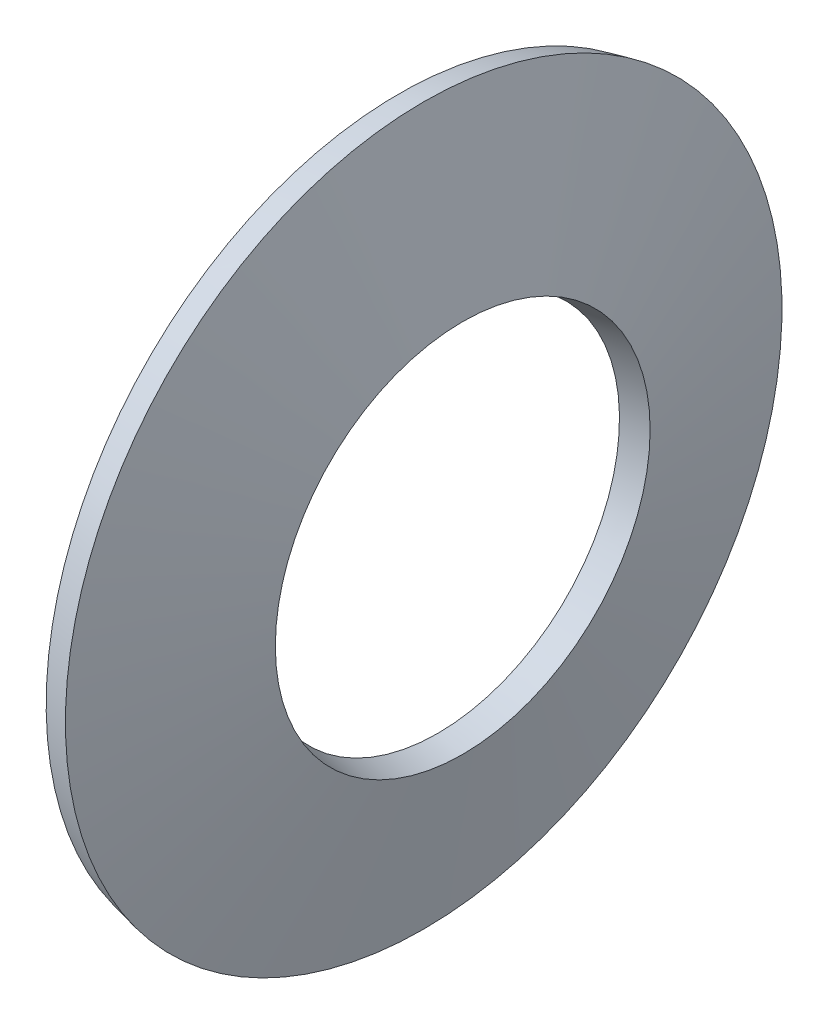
ISO-10303-21;
HEADER;
FILE_DESCRIPTION(('STEP AP214'),'2;1');
FILE_NAME('part.step','',(''),(''),'','','');
FILE_SCHEMA(('AUTOMOTIVE_DESIGN { 1 0 10303 214 1 1 1 1 }'));
ENDSEC;
DATA;
#1=APPLICATION_CONTEXT('core data for automotive mechanical design processes');
#2=APPLICATION_PROTOCOL_DEFINITION('international standard','automotive_design',2000,#1);
#3=PRODUCT_CONTEXT('',#1,'mechanical');
#4=PRODUCT('Part','Part','',(#3));
#5=PRODUCT_RELATED_PRODUCT_CATEGORY('part','',(#4));
#6=PRODUCT_DEFINITION_FORMATION('','',#4);
#7=PRODUCT_DEFINITION_CONTEXT('part definition',#1,'design');
#8=PRODUCT_DEFINITION('design','',#6,#7);
#9=PRODUCT_DEFINITION_SHAPE('','',#8);
#10=(LENGTH_UNIT() NAMED_UNIT(*) SI_UNIT(.MILLI.,.METRE.));
#11=(NAMED_UNIT(*) PLANE_ANGLE_UNIT() SI_UNIT($,.RADIAN.));
#12=(NAMED_UNIT(*) SI_UNIT($,.STERADIAN.) SOLID_ANGLE_UNIT());
#13=UNCERTAINTY_MEASURE_WITH_UNIT(LENGTH_MEASURE(1.E-05),#10,'distance_accuracy_value','');
#14=(GEOMETRIC_REPRESENTATION_CONTEXT(3) GLOBAL_UNCERTAINTY_ASSIGNED_CONTEXT((#13)) GLOBAL_UNIT_ASSIGNED_CONTEXT((#10,
#11,#12)) REPRESENTATION_CONTEXT('',''));
#15=CARTESIAN_POINT('',(0.,0.,0.));
#16=DIRECTION('',(0.,0.,1.));
#17=DIRECTION('',(1.,0.,0.));
#18=AXIS2_PLACEMENT_3D('',#15,#16,#17);
#19=CARTESIAN_POINT('',(0.974894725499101,0.,0.));
#20=DIRECTION('',(1.,0.,0.));
#21=DIRECTION('',(0.,1.,0.));
#22=AXIS2_PLACEMENT_3D('',#19,#20,#21);
#23=CONICAL_SURFACE('',#22,14.,0.224548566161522);
#24=CARTESIAN_POINT('',(0.,0.,0.));
#25=DIRECTION('',(-1.,0.,0.));
#26=DIRECTION('',(0.,-1.,0.));
#27=AXIS2_PLACEMENT_3D('',#24,#25,#26);
#28=CIRCLE('',#27,13.7773337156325);
#29=CARTESIAN_POINT('',(0.,-13.7773337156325,0.));
#30=VERTEX_POINT('',#29);
#31=EDGE_CURVE('E44',#30,#30,#28,.T.);
#32=ORIENTED_EDGE('',*,*,#31,.F.);
#33=EDGE_LOOP('',(#32));
#34=FACE_BOUND('',#33,.T.);
#35=CARTESIAN_POINT('',(0.974894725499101,0.,0.));
#36=DIRECTION('',(-1.,0.,0.));
#37=DIRECTION('',(0.,-1.,0.));
#38=AXIS2_PLACEMENT_3D('',#35,#36,#37);
#39=CIRCLE('',#38,14.);
#40=CARTESIAN_POINT('',(0.974894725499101,-14.,0.));
#41=VERTEX_POINT('',#40);
#42=EDGE_CURVE('E10',#41,#41,#39,.T.);
#43=ORIENTED_EDGE('',*,*,#42,.T.);
#44=EDGE_LOOP('',(#43));
#45=FACE_BOUND('',#44,.T.);
#46=ADVANCED_FACE('F30',(#34,#45),#23,.T.);
#47=CARTESIAN_POINT('',(2.5,0.,0.));
#48=DIRECTION('',(-1.,0.,0.));
#49=DIRECTION('',(0.,-1.,0.));
#50=AXIS2_PLACEMENT_3D('',#47,#48,#49);
#51=CONICAL_SURFACE('',#50,7.32266628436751,1.34624776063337);
#52=ORIENTED_EDGE('',*,*,#42,.F.);
#53=EDGE_LOOP('',(#52));
#54=FACE_BOUND('',#53,.T.);
#55=CARTESIAN_POINT('',(2.5,0.,0.));
#56=DIRECTION('',(-1.,0.,0.));
#57=DIRECTION('',(0.,-1.,0.));
#58=AXIS2_PLACEMENT_3D('',#55,#56,#57);
#59=CIRCLE('',#58,7.32266628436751);
#60=CARTESIAN_POINT('',(2.5,-7.32266628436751,0.));
#61=VERTEX_POINT('',#60);
#62=EDGE_CURVE('E36',#61,#61,#59,.T.);
#63=ORIENTED_EDGE('',*,*,#62,.T.);
#64=EDGE_LOOP('',(#63));
#65=FACE_BOUND('',#64,.T.);
#66=ADVANCED_FACE('F53',(#54,#65),#51,.T.);
#67=CARTESIAN_POINT('',(1.5251052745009,0.,0.));
#68=DIRECTION('',(1.,0.,0.));
#69=DIRECTION('',(0.,1.,0.));
#70=AXIS2_PLACEMENT_3D('',#67,#68,#69);
#71=CONICAL_SURFACE('',#70,7.1,0.224548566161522);
#72=ORIENTED_EDGE('',*,*,#62,.F.);
#73=EDGE_LOOP('',(#72));
#74=FACE_BOUND('',#73,.T.);
#75=CARTESIAN_POINT('',(1.5251052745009,0.,0.));
#76=DIRECTION('',(-1.,0.,0.));
#77=DIRECTION('',(0.,-1.,0.));
#78=AXIS2_PLACEMENT_3D('',#75,#76,#77);
#79=CIRCLE('',#78,7.1);
#80=CARTESIAN_POINT('',(1.5251052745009,-7.1,0.));
#81=VERTEX_POINT('',#80);
#82=EDGE_CURVE('E40',#81,#81,#79,.T.);
#83=ORIENTED_EDGE('',*,*,#82,.T.);
#84=EDGE_LOOP('',(#83));
#85=FACE_BOUND('',#84,.T.);
#86=ADVANCED_FACE('F57',(#74,#85),#71,.F.);
#87=CARTESIAN_POINT('',(0.,0.,0.));
#88=DIRECTION('',(-1.,0.,0.));
#89=DIRECTION('',(0.,-1.,0.));
#90=AXIS2_PLACEMENT_3D('',#87,#88,#89);
#91=CONICAL_SURFACE('',#90,13.7773337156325,1.34624776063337);
#92=ORIENTED_EDGE('',*,*,#82,.F.);
#93=EDGE_LOOP('',(#92));
#94=FACE_BOUND('',#93,.T.);
#95=ORIENTED_EDGE('',*,*,#31,.T.);
#96=EDGE_LOOP('',(#95));
#97=FACE_BOUND('',#96,.T.);
#98=ADVANCED_FACE('F50',(#94,#97),#91,.F.);
#99=CLOSED_SHELL('',(#46,#66,#86,#98));
#100=MANIFOLD_SOLID_BREP('B2',#99);
#101=ADVANCED_BREP_SHAPE_REPRESENTATION('',(#18,#100),#14);
#102=SHAPE_DEFINITION_REPRESENTATION(#9,#101);
ENDSEC;
END-ISO-10303-21;
